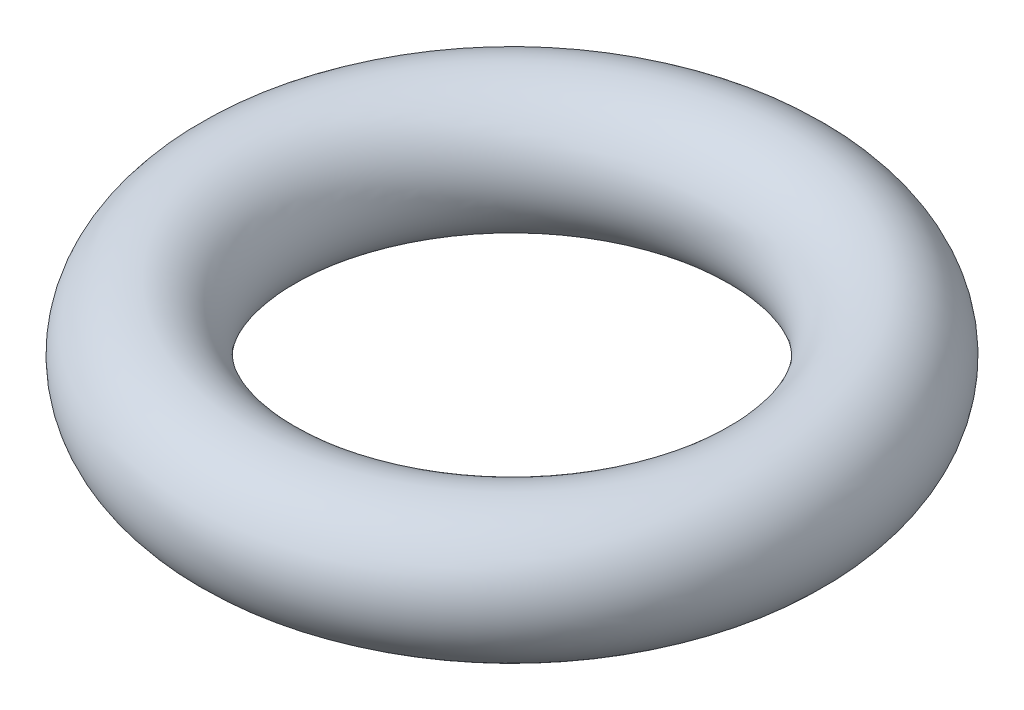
ISO-10303-21;
HEADER;
FILE_DESCRIPTION(('STEP AP214'),'2;1');
FILE_NAME('part.step','',(''),(''),'','','');
FILE_SCHEMA(('AUTOMOTIVE_DESIGN { 1 0 10303 214 1 1 1 1 }'));
ENDSEC;
DATA;
#1=APPLICATION_CONTEXT('core data for automotive mechanical design processes');
#2=APPLICATION_PROTOCOL_DEFINITION('international standard','automotive_design',2000,#1);
#3=PRODUCT_CONTEXT('',#1,'mechanical');
#4=PRODUCT('Part','Part','',(#3));
#5=PRODUCT_RELATED_PRODUCT_CATEGORY('part','',(#4));
#6=PRODUCT_DEFINITION_FORMATION('','',#4);
#7=PRODUCT_DEFINITION_CONTEXT('part definition',#1,'design');
#8=PRODUCT_DEFINITION('design','',#6,#7);
#9=PRODUCT_DEFINITION_SHAPE('','',#8);
#10=(LENGTH_UNIT() NAMED_UNIT(*) SI_UNIT(.MILLI.,.METRE.));
#11=(NAMED_UNIT(*) PLANE_ANGLE_UNIT() SI_UNIT($,.RADIAN.));
#12=(NAMED_UNIT(*) SI_UNIT($,.STERADIAN.) SOLID_ANGLE_UNIT());
#13=UNCERTAINTY_MEASURE_WITH_UNIT(LENGTH_MEASURE(1.E-05),#10,'distance_accuracy_value','');
#14=(GEOMETRIC_REPRESENTATION_CONTEXT(3) GLOBAL_UNCERTAINTY_ASSIGNED_CONTEXT((#13)) GLOBAL_UNIT_ASSIGNED_CONTEXT((#10,
#11,#12)) REPRESENTATION_CONTEXT('',''));
#15=CARTESIAN_POINT('',(0.,0.,0.));
#16=DIRECTION('',(0.,0.,1.));
#17=DIRECTION('',(1.,0.,0.));
#18=AXIS2_PLACEMENT_3D('',#15,#16,#17);
#19=CARTESIAN_POINT('',(0.,0.,0.));
#20=DIRECTION('',(0.,1.,0.));
#21=DIRECTION('',(0.,0.,1.));
#22=AXIS2_PLACEMENT_3D('',#19,#20,#21);
#23=TOROIDAL_SURFACE('',#22,4.8,1.2);
#24=CARTESIAN_POINT('',(0.,0.,5.99999999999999));
#25=VERTEX_POINT('',#24);
#26=VERTEX_LOOP('',#25);
#27=FACE_BOUND('',#26,.T.);
#28=ADVANCED_FACE('F352',(#27),#23,.T.);
#29=CLOSED_SHELL('',(#28));
#30=MANIFOLD_SOLID_BREP('B2',#29);
#31=ADVANCED_BREP_SHAPE_REPRESENTATION('',(#18,#30),#14);
#32=SHAPE_DEFINITION_REPRESENTATION(#9,#31);
ENDSEC;
END-ISO-10303-21;
